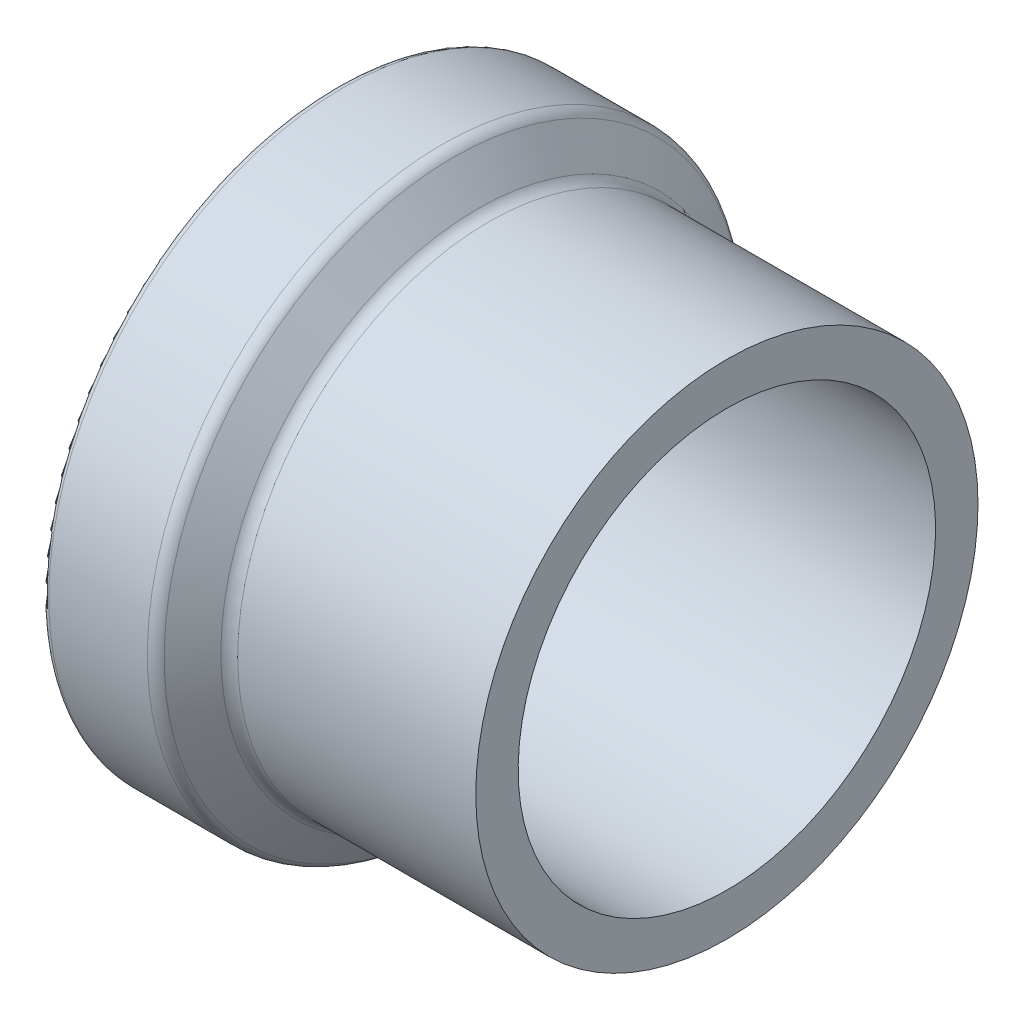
from build123d import *


with BuildPart() as part:
    # Sketch1 → Revolve1 (revolve)
    with BuildSketch(Plane.XY):
        with BuildLine():
            Line((8.660416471, 23.749), (-27.991783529, 23.749))
            Line((-27.991783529, 23.749), (-27.991783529, 27.8003))
            ThreePointArc((-27.991783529, 27.8003), (-28.229847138, 28.375036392), (-28.804583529, 28.6131))
            Line((-28.804583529, 28.6131), (-34.976783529, 28.6131))
            ThreePointArc((-34.976783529, 28.6131), (-35.551519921, 28.851163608), (-35.789583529, 29.4259))
            Line((-35.789583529, 29.4259), (-35.789583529, 32.7152))
            ThreePointArc((-35.789583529, 32.7152), (-35.551519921, 33.289936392), (-34.976783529, 33.528))
            Line((-34.976783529, 33.528), (-23.760413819, 33.528))
            ThreePointArc((-23.760413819, 33.528), (-23.046408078, 33.359873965), (-22.482437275, 32.8908244))
            Line((-22.482437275, 32.8908244), (-19.710376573, 29.2121756))
            ThreePointArc((-19.710376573, 29.2121756), (-19.146405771, 28.743126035), (-18.43240003, 28.575))
            Line((-18.43240003, 28.575), (8.660416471, 28.575))
            Line((8.660416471, 28.575), (8.660416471, 23.749))
        make_face()
    revolve(axis=Axis((0, 0, 0), (-1, 0, 0)))


solid = part.part
